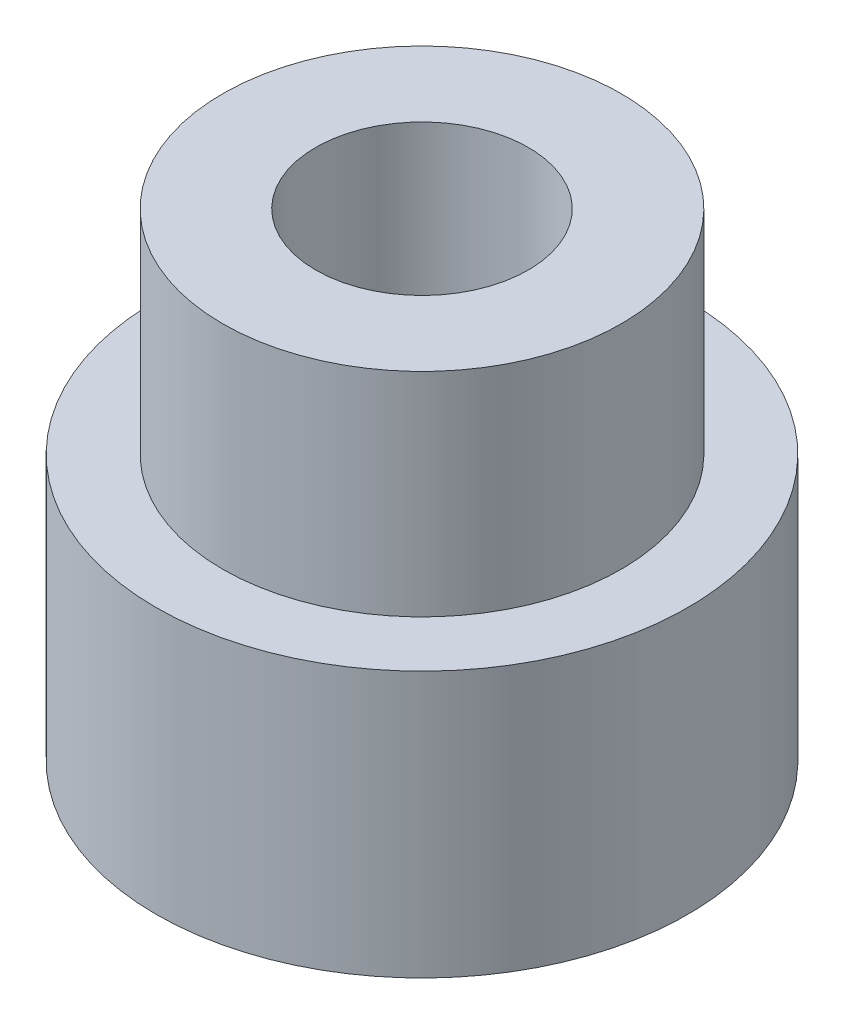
from build123d import *


with BuildPart() as part:
    # Skizze1 → Basis-Rotation (revolve)
    with BuildSketch(Plane.XY, mode=Mode.PRIVATE) as basis_rotation_sk:
        Polygon((8, 36), (8, 0), (20, 0), (20, 20), (15, 20), (15, 36), align=None)
    revolve(basis_rotation_sk.sketch.rotate(Axis((0, 0, 0), (0, -1, 0)), 90), axis=Axis((0, 0, 0), (0, -1, 0)))


solid = part.part
